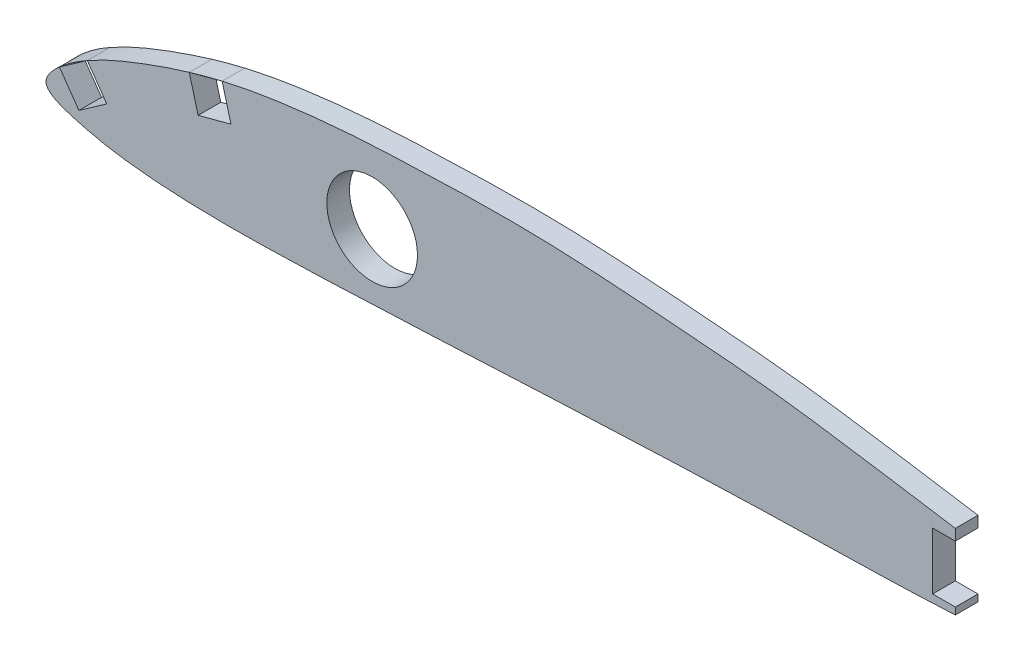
from build123d import *

# Parameters (mm, degrees)
BOSS_EXTRUDE1_DEPTH = 3.175
SKETCH1_R           = 6.35
CUT_EXTRUDE1_DEPTH  = 10


with BuildPart() as part:
    # 3DSketch1 → Boss-Extrude1 (new body)
    with BuildSketch(Plane(origin=(0, 0, 0), x_dir=(0.999981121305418, -0.006144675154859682, 0), z_dir=(0, 0, 1))):
        with BuildLine():
            add(Edge.make_bspline(
                [(0, 0), (-0.052842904, 0.91649344), (1.936410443, 2.986801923), (4.767212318, 5.040677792), (8.440166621, 7.047740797), (15.479720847, 9.961771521), (24.023730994, 12.745735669), (34.147331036, 14.428539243), (42.730842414, 15.338446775), (54.160402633, 15.887834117), (68.46292336, 16.38146648), (85.591382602, 15.28504194), (102.844327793, 14.047302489), (119.714309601, 11.451078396), (137.810424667, 8.798314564), (151.627699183, 5.63720416), (181.033511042, 0), (143.023429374, 1.105002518), (126.506614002, -0.508948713), (90.834656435, -1.290549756), (62.956643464, -2.981462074), (34.251828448, -4.409445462), (20.142587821, -4.727527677), (9.750274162, -3.785419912), (4.455421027, -2.60894423), (0.072514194, -1.25766713), (0, 0)],
                knots=[0, 0, 0, 0, 0.010560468, 0.018211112, 0.032209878, 0.045524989, 0.084069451, 0.108974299, 0.133649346, 0.158232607, 0.207343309, 0.256522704, 0.305826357, 0.355445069, 0.405214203, 0.45539047, 0.506006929, 0.555121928, 0.653369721, 0.702490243, 0.849938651, 0.899083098, 0.948194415, 0.97290595, 0.985508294, 1, 1, 1, 1], degree=3))
        make_face()
    extrude(amount=BOSS_EXTRUDE1_DEPTH)

    # Sketch1 → Cut-Extrude1 (cut)
    with BuildSketch(Plane.XY.offset(3.175)):
        with Locations((45.68, 5)):
            Circle(SKETCH1_R)
        Polygon((127.362, 0), (127.362, -12.199389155), (187.362, -12.199389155), (187.362, 17.103743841), (127.362, 17.103743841), (127.362, 8), (124.187, 8), (124.187, 0), align=None)
        Polygon((5.780071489, 5.4986391), (1.878859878, 2.766981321), (4.610517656, -1.134230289), (8.511729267, 1.597427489), align=None)
        Polygon((20.071317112, 11.211877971), (24.671538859, 12.444503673), (25.904164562, 7.844281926), (21.303942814, 6.611656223), align=None)
    extrude(amount=-CUT_EXTRUDE1_DEPTH, mode=Mode.SUBTRACT)


solid = part.part
